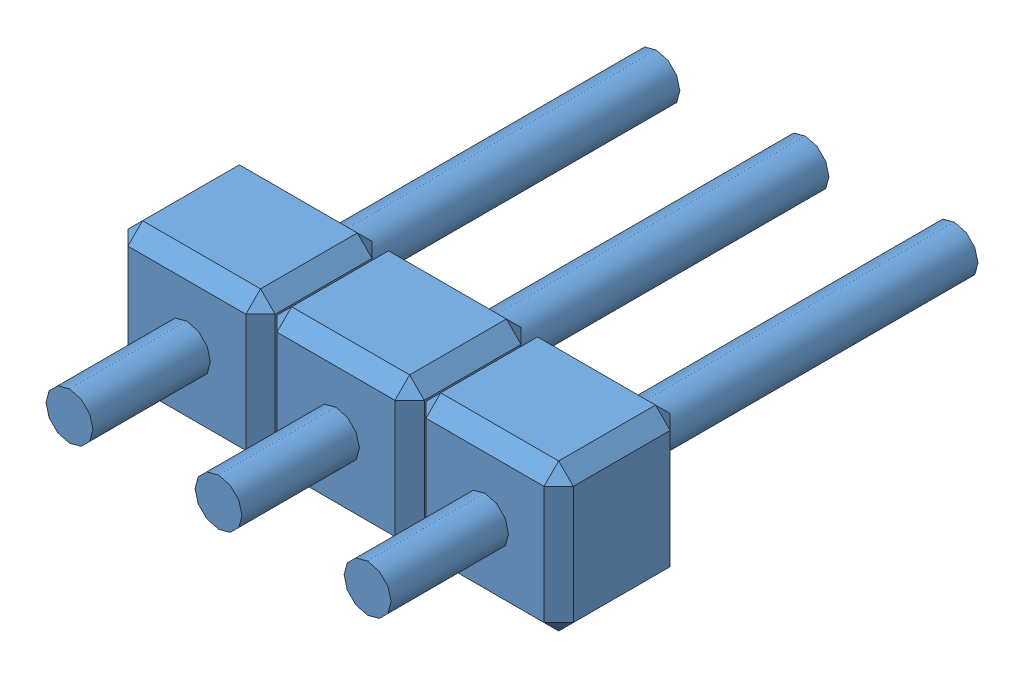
SolidWorks assembly ASB 3PICOTS avec capuchon.SLDASM, configuration Default (file format 4700). Lengths in mm.
Overall size (7.59 2.51 10).
3 component instances, 1 part files, 6 mates.
Components (placement in the parent):
- PICOT-1: PICOT.SLDPRT [Default] at (26.8516 -23.7306 1.953) size (2.51 2.51 10)
- PICOT-2: PICOT.SLDPRT [Default] at (29.3916 -23.7306 1.953) size (2.51 2.51 10)
- PICOT-3: PICOT.SLDPRT [Default] at (24.3116 -23.7306 1.953) size (2.51 2.51 10)
Mates (geometry in assembly coordinates):
- Coïncidente4: coincident aligned: plane of PICOT-1 through (-3.6488 -1.9209 4.103) normal (0 -1 0); plane of PICOT-2 through (-1.1088 -1.9209 4.103) normal (0 -1 0)
- Coïncidente5: coincident aligned: plane of PICOT-1 through (-3.6488 -1.9209 4.103) normal (0 0 1); plane of PICOT-2 through (-1.1088 -1.9209 4.103) normal (0 0 1)
- Distance1: distance = 0.03 mm anti-aligned: plane of PICOT-1 through (-1.1388 0.5891 4.103) normal (1 0 0); plane of PICOT-2 through (-1.1088 0.5891 4.103) normal (-1 0 0)
- Coïncidente6: coincident aligned: plane of PICOT-1 through (-3.6488 0.5891 4.103) normal (0 1 0); plane of PICOT-3 through (-6.1888 0.5891 4.103) normal (0 1 0)
- Coïncidente7: coincident aligned: plane of PICOT-1 through (-3.6488 -1.9209 1.953) normal (0 0 -1); plane of PICOT-3 through (-6.1888 -1.9209 1.953) normal (0 0 -1)
- Distance2: distance = 0.03 mm anti-aligned: plane of PICOT-1 through (-3.6488 0.5891 4.103) normal (-1 0 0); plane of PICOT-3 through (-3.6788 0.5891 4.103) normal (1 0 0)
